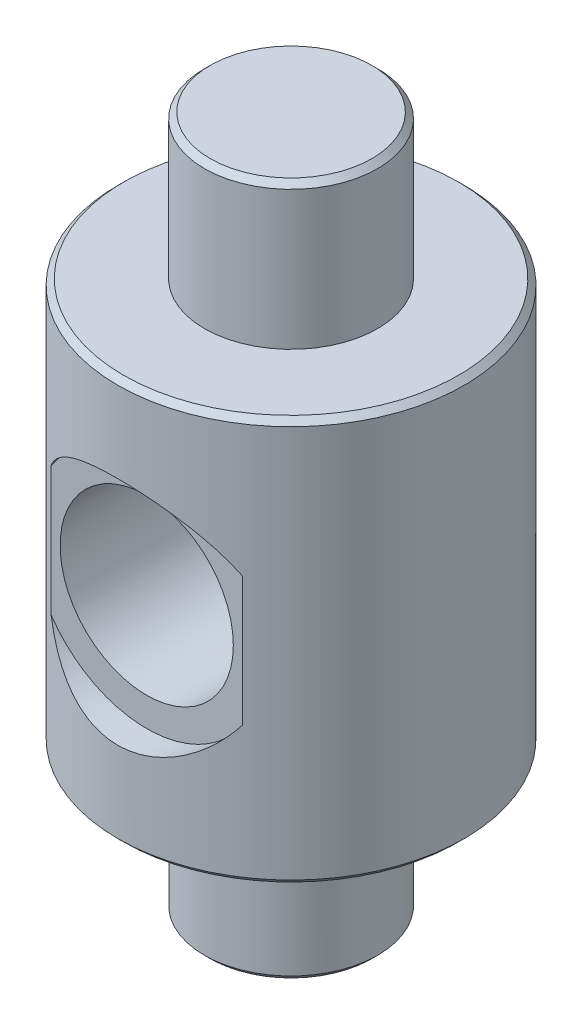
ISO-10303-21;
HEADER;
FILE_DESCRIPTION(('STEP AP214'),'2;1');
FILE_NAME('part.step','',(''),(''),'','','');
FILE_SCHEMA(('AUTOMOTIVE_DESIGN { 1 0 10303 214 1 1 1 1 }'));
ENDSEC;
DATA;
#1=APPLICATION_CONTEXT('core data for automotive mechanical design processes');
#2=APPLICATION_PROTOCOL_DEFINITION('international standard','automotive_design',2000,#1);
#3=PRODUCT_CONTEXT('',#1,'mechanical');
#4=PRODUCT('Part','Part','',(#3));
#5=PRODUCT_RELATED_PRODUCT_CATEGORY('part','',(#4));
#6=PRODUCT_DEFINITION_FORMATION('','',#4);
#7=PRODUCT_DEFINITION_CONTEXT('part definition',#1,'design');
#8=PRODUCT_DEFINITION('design','',#6,#7);
#9=PRODUCT_DEFINITION_SHAPE('','',#8);
#10=(LENGTH_UNIT() NAMED_UNIT(*) SI_UNIT(.MILLI.,.METRE.));
#11=(NAMED_UNIT(*) PLANE_ANGLE_UNIT() SI_UNIT($,.RADIAN.));
#12=(NAMED_UNIT(*) SI_UNIT($,.STERADIAN.) SOLID_ANGLE_UNIT());
#13=UNCERTAINTY_MEASURE_WITH_UNIT(LENGTH_MEASURE(1.E-05),#10,'distance_accuracy_value','');
#14=(GEOMETRIC_REPRESENTATION_CONTEXT(3) GLOBAL_UNCERTAINTY_ASSIGNED_CONTEXT((#13)) GLOBAL_UNIT_ASSIGNED_CONTEXT((#10,
#11,#12)) REPRESENTATION_CONTEXT('',''));
#15=CARTESIAN_POINT('',(0.,0.,0.));
#16=DIRECTION('',(0.,0.,1.));
#17=DIRECTION('',(1.,0.,0.));
#18=AXIS2_PLACEMENT_3D('',#15,#16,#17);
#19=CARTESIAN_POINT('',(0.,0.,0.));
#20=DIRECTION('',(0.,1.,0.));
#21=DIRECTION('',(0.,0.,1.));
#22=AXIS2_PLACEMENT_3D('',#19,#20,#21);
#23=CYLINDRICAL_SURFACE('',#22,3.);
#24=CARTESIAN_POINT('',(0.,2.6,0.));
#25=DIRECTION('',(0.,-1.,0.));
#26=DIRECTION('',(0.,0.,-1.));
#27=AXIS2_PLACEMENT_3D('',#24,#25,#26);
#28=CIRCLE('',#27,3.);
#29=CARTESIAN_POINT('',(0.,2.6,3.));
#30=VERTEX_POINT('',#29);
#31=EDGE_CURVE('E188',#30,#30,#28,.F.);
#32=ORIENTED_EDGE('',*,*,#31,.T.);
#33=EDGE_LOOP('',(#32));
#34=FACE_BOUND('',#33,.T.);
#35=CARTESIAN_POINT('',(0.,9.4,0.));
#36=DIRECTION('',(0.,1.,0.));
#37=DIRECTION('',(0.,0.,1.));
#38=AXIS2_PLACEMENT_3D('',#35,#36,#37);
#39=CIRCLE('',#38,3.);
#40=CARTESIAN_POINT('',(0.,9.4,3.));
#41=VERTEX_POINT('',#40);
#42=EDGE_CURVE('E191',#41,#41,#39,.F.);
#43=ORIENTED_EDGE('',*,*,#42,.T.);
#44=EDGE_LOOP('',(#43));
#45=FACE_BOUND('',#44,.T.);
#46=CARTESIAN_POINT('',(1.6583123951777,7.11803398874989,2.5));
#47=CARTESIAN_POINT('',(1.62588041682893,7.16611825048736,2.52151479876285));
#48=CARTESIAN_POINT('',(1.59147775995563,7.21265161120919,2.54342347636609));
#49=CARTESIAN_POINT('',(1.51881718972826,7.30251544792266,2.5874697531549));
#50=CARTESIAN_POINT('',(1.48055809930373,7.34584493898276,2.60960742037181));
#51=CARTESIAN_POINT('',(1.35957897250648,7.47143319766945,2.67582114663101));
#52=CARTESIAN_POINT('',(1.27112677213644,7.54859526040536,2.71937159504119));
#53=CARTESIAN_POINT('',(1.08001742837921,7.68747041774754,2.80078430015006));
#54=CARTESIAN_POINT('',(0.977318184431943,7.74913614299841,2.83862897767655));
#55=CARTESIAN_POINT('',(0.760170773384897,7.85379775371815,2.90429124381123));
#56=CARTESIAN_POINT('',(0.645766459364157,7.896860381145,2.93214461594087));
#57=CARTESIAN_POINT('',(0.422457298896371,7.95788993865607,2.97201413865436));
#58=CARTESIAN_POINT('',(0.314455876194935,7.97818990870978,2.98549347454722));
#59=CARTESIAN_POINT('',(0.0957318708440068,8.00072276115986,3.00046894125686));
#60=CARTESIAN_POINT('',(-0.0149896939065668,8.00296230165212,3.00196948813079));
#61=CARTESIAN_POINT('',(-0.219788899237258,7.9901684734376,2.99345292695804));
#62=CARTESIAN_POINT('',(-0.314087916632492,7.97743571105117,2.98496974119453));
#63=CARTESIAN_POINT('',(-0.498831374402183,7.93908854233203,2.95970537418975));
#64=CARTESIAN_POINT('',(-0.589276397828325,7.91347609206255,2.94292545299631));
#65=CARTESIAN_POINT('',(-0.766037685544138,7.84991700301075,2.90199776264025));
#66=CARTESIAN_POINT('',(-0.852235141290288,7.81173384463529,2.87770930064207));
#67=CARTESIAN_POINT('',(-1.01715798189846,7.72455932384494,2.8236387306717));
#68=CARTESIAN_POINT('',(-1.09587569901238,7.67555703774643,2.79385107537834));
#69=CARTESIAN_POINT('',(-1.25565427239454,7.56025585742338,2.72615287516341));
#70=CARTESIAN_POINT('',(-1.33541158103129,7.49248101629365,2.68769051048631));
#71=CARTESIAN_POINT('',(-1.48295801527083,7.34596800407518,2.60917581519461));
#72=CARTESIAN_POINT('',(-1.55076586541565,7.26724733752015,2.56912609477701));
#73=CARTESIAN_POINT('',(-1.62799531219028,7.16204151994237,2.51991822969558));
#74=CARTESIAN_POINT('',(-1.64336841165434,7.14019728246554,2.5099145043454));
#75=CARTESIAN_POINT('',(-1.6583123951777,7.11803398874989,2.5));
#76=B_SPLINE_CURVE_WITH_KNOTS('',3,(#46,#47,#48,#49,#50,#51,#52,#53,#54,#55,#56,#57,#58,#59,#60,
#61,#62,#63,#64,#65,#66,#67,#68,#69,#70,#71,#72,#73,#74,#75),.UNSPECIFIED.,.F.,.F.,(4,2,2,2,2,2,
2,2,2,2,2,2,2,2,4),(0.,0.185463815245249,0.370984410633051,0.744697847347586,1.1195401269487,
1.49302619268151,1.82315350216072,2.1531591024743,2.43842427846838,2.72364614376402,
3.01457448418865,3.30579791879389,3.6390815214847,3.97183814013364,4.05738621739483),.UNSPECIFIED.);
#77=CARTESIAN_POINT('',(1.6583123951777,7.11803398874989,2.5));
#78=VERTEX_POINT('',#77);
#79=CARTESIAN_POINT('',(-1.6583123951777,7.11803398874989,2.5));
#80=VERTEX_POINT('',#79);
#81=EDGE_CURVE('E144',#78,#80,#76,.T.);
#82=ORIENTED_EDGE('',*,*,#81,.F.);
#83=DIRECTION('',(0.,1.,0.));
#84=VECTOR('',#83,1.);
#85=CARTESIAN_POINT('',(1.6583123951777,0.,2.5));
#86=LINE('',#85,#84);
#87=CARTESIAN_POINT('',(1.6583123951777,4.88196601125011,2.5));
#88=VERTEX_POINT('',#87);
#89=EDGE_CURVE('E95',#78,#88,#86,.F.);
#90=ORIENTED_EDGE('',*,*,#89,.T.);
#91=CARTESIAN_POINT('',(-1.6583123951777,4.88196601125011,2.5));
#92=CARTESIAN_POINT('',(-1.62588041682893,4.83388174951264,2.52151479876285));
#93=CARTESIAN_POINT('',(-1.59147775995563,4.78734838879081,2.54342347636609));
#94=CARTESIAN_POINT('',(-1.51881718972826,4.69748455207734,2.5874697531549));
#95=CARTESIAN_POINT('',(-1.48055809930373,4.65415506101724,2.60960742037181));
#96=CARTESIAN_POINT('',(-1.35957897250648,4.52856680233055,2.67582114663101));
#97=CARTESIAN_POINT('',(-1.27112677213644,4.45140473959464,2.71937159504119));
#98=CARTESIAN_POINT('',(-1.08001742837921,4.31252958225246,2.80078430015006));
#99=CARTESIAN_POINT('',(-0.977318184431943,4.25086385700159,2.83862897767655));
#100=CARTESIAN_POINT('',(-0.760170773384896,4.14620224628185,2.90429124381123));
#101=CARTESIAN_POINT('',(-0.645766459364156,4.103139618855,2.93214461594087));
#102=CARTESIAN_POINT('',(-0.42245729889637,4.04211006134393,2.97201413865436));
#103=CARTESIAN_POINT('',(-0.314455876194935,4.02181009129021,2.98549347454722));
#104=CARTESIAN_POINT('',(-0.0957318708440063,3.99927723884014,3.00046894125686));
#105=CARTESIAN_POINT('',(0.0149896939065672,3.99703769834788,3.00196948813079));
#106=CARTESIAN_POINT('',(0.219788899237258,4.00983152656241,2.99345292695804));
#107=CARTESIAN_POINT('',(0.314087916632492,4.02256428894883,2.98496974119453));
#108=CARTESIAN_POINT('',(0.498831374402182,4.06091145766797,2.95970537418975));
#109=CARTESIAN_POINT('',(0.589276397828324,4.08652390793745,2.94292545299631));
#110=CARTESIAN_POINT('',(0.766037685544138,4.15008299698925,2.90199776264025));
#111=CARTESIAN_POINT('',(0.852235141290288,4.18826615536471,2.87770930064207));
#112=CARTESIAN_POINT('',(1.01715798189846,4.27544067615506,2.8236387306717));
#113=CARTESIAN_POINT('',(1.09587569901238,4.32444296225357,2.79385107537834));
#114=CARTESIAN_POINT('',(1.25565427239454,4.43974414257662,2.72615287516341));
#115=CARTESIAN_POINT('',(1.33541158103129,4.50751898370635,2.68769051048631));
#116=CARTESIAN_POINT('',(1.48295801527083,4.65403199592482,2.60917581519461));
#117=CARTESIAN_POINT('',(1.55076586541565,4.73275266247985,2.56912609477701));
#118=CARTESIAN_POINT('',(1.62799531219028,4.83795848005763,2.51991822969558));
#119=CARTESIAN_POINT('',(1.64336841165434,4.85980271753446,2.5099145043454));
#120=CARTESIAN_POINT('',(1.6583123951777,4.88196601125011,2.5));
#121=B_SPLINE_CURVE_WITH_KNOTS('',3,(#91,#92,#93,#94,#95,#96,#97,#98,#99,#100,#101,#102,#103,
#104,#105,#106,#107,#108,#109,#110,#111,#112,#113,#114,#115,#116,#117,#118,#119,#120),
.UNSPECIFIED.,.F.,.F.,(4,2,2,2,2,2,2,2,2,2,2,2,2,2,4),(0.,0.185463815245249,0.370984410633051,
0.744697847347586,1.1195401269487,1.49302619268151,1.82315350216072,2.1531591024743,
2.43842427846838,2.72364614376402,3.01457448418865,3.30579791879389,3.6390815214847,
3.97183814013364,4.05738621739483),.UNSPECIFIED.);
#122=CARTESIAN_POINT('',(-1.6583123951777,4.88196601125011,2.5));
#123=VERTEX_POINT('',#122);
#124=EDGE_CURVE('E137',#123,#88,#121,.T.);
#125=ORIENTED_EDGE('',*,*,#124,.F.);
#126=DIRECTION('',(0.,1.,0.));
#127=VECTOR('',#126,1.);
#128=CARTESIAN_POINT('',(-1.6583123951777,0.,2.5));
#129=LINE('',#128,#127);
#130=EDGE_CURVE('E99',#123,#80,#129,.T.);
#131=ORIENTED_EDGE('',*,*,#130,.T.);
#132=EDGE_LOOP('',(#82,#90,#125,#131));
#133=FACE_BOUND('',#132,.T.);
#134=DIRECTION('',(0.,1.,0.));
#135=VECTOR('',#134,1.);
#136=CARTESIAN_POINT('',(-1.6583123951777,0.,-2.5));
#137=LINE('',#136,#135);
#138=CARTESIAN_POINT('',(-1.6583123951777,7.11803398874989,-2.5));
#139=VERTEX_POINT('',#138);
#140=CARTESIAN_POINT('',(-1.6583123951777,4.88196601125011,-2.5));
#141=VERTEX_POINT('',#140);
#142=EDGE_CURVE('E80',#139,#141,#137,.F.);
#143=ORIENTED_EDGE('',*,*,#142,.T.);
#144=CARTESIAN_POINT('',(-1.6583123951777,4.88196601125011,-2.5));
#145=CARTESIAN_POINT('',(-1.62588041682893,4.83388174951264,-2.52151479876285));
#146=CARTESIAN_POINT('',(-1.59147775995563,4.78734838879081,-2.54342347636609));
#147=CARTESIAN_POINT('',(-1.51881718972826,4.69748455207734,-2.5874697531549));
#148=CARTESIAN_POINT('',(-1.48055809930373,4.65415506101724,-2.60960742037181));
#149=CARTESIAN_POINT('',(-1.35957897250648,4.52856680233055,-2.67582114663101));
#150=CARTESIAN_POINT('',(-1.27112677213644,4.45140473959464,-2.71937159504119));
#151=CARTESIAN_POINT('',(-1.08001742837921,4.31252958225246,-2.80078430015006));
#152=CARTESIAN_POINT('',(-0.977318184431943,4.25086385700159,-2.83862897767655));
#153=CARTESIAN_POINT('',(-0.760170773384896,4.14620224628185,-2.90429124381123));
#154=CARTESIAN_POINT('',(-0.645766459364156,4.103139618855,-2.93214461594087));
#155=CARTESIAN_POINT('',(-0.42245729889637,4.04211006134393,-2.97201413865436));
#156=CARTESIAN_POINT('',(-0.314455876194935,4.02181009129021,-2.98549347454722));
#157=CARTESIAN_POINT('',(-0.0957318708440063,3.99927723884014,-3.00046894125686));
#158=CARTESIAN_POINT('',(0.0149896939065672,3.99703769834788,-3.00196948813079));
#159=CARTESIAN_POINT('',(0.219788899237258,4.00983152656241,-2.99345292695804));
#160=CARTESIAN_POINT('',(0.314087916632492,4.02256428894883,-2.98496974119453));
#161=CARTESIAN_POINT('',(0.498831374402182,4.06091145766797,-2.95970537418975));
#162=CARTESIAN_POINT('',(0.589276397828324,4.08652390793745,-2.94292545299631));
#163=CARTESIAN_POINT('',(0.766037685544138,4.15008299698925,-2.90199776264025));
#164=CARTESIAN_POINT('',(0.852235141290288,4.18826615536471,-2.87770930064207));
#165=CARTESIAN_POINT('',(1.01715798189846,4.27544067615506,-2.8236387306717));
#166=CARTESIAN_POINT('',(1.09587569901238,4.32444296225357,-2.79385107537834));
#167=CARTESIAN_POINT('',(1.25565427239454,4.43974414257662,-2.72615287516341));
#168=CARTESIAN_POINT('',(1.33541158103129,4.50751898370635,-2.68769051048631));
#169=CARTESIAN_POINT('',(1.48295801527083,4.65403199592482,-2.60917581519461));
#170=CARTESIAN_POINT('',(1.55076586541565,4.73275266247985,-2.56912609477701));
#171=CARTESIAN_POINT('',(1.62799531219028,4.83795848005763,-2.51991822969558));
#172=CARTESIAN_POINT('',(1.64336841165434,4.85980271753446,-2.5099145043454));
#173=CARTESIAN_POINT('',(1.6583123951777,4.88196601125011,-2.5));
#174=B_SPLINE_CURVE_WITH_KNOTS('',3,(#144,#145,#146,#147,#148,#149,#150,#151,#152,#153,#154,
#155,#156,#157,#158,#159,#160,#161,#162,#163,#164,#165,#166,#167,#168,#169,#170,#171,#172,#173),
.UNSPECIFIED.,.F.,.F.,(4,2,2,2,2,2,2,2,2,2,2,2,2,2,4),(0.,0.185463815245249,0.370984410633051,
0.744697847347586,1.1195401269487,1.49302619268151,1.82315350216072,2.1531591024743,
2.43842427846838,2.72364614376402,3.01457448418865,3.30579791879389,3.6390815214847,
3.97183814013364,4.05738621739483),.UNSPECIFIED.);
#175=CARTESIAN_POINT('',(1.6583123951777,4.88196601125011,-2.5));
#176=VERTEX_POINT('',#175);
#177=EDGE_CURVE('E94',#141,#176,#174,.T.);
#178=ORIENTED_EDGE('',*,*,#177,.T.);
#179=DIRECTION('',(0.,1.,0.));
#180=VECTOR('',#179,1.);
#181=CARTESIAN_POINT('',(1.6583123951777,0.,-2.5));
#182=LINE('',#181,#180);
#183=CARTESIAN_POINT('',(1.6583123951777,7.11803398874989,-2.5));
#184=VERTEX_POINT('',#183);
#185=EDGE_CURVE('E89',#176,#184,#182,.T.);
#186=ORIENTED_EDGE('',*,*,#185,.T.);
#187=CARTESIAN_POINT('',(1.6583123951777,7.11803398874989,-2.5));
#188=CARTESIAN_POINT('',(1.62588041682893,7.16611825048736,-2.52151479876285));
#189=CARTESIAN_POINT('',(1.59147775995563,7.21265161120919,-2.54342347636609));
#190=CARTESIAN_POINT('',(1.51881718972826,7.30251544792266,-2.5874697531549));
#191=CARTESIAN_POINT('',(1.48055809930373,7.34584493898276,-2.60960742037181));
#192=CARTESIAN_POINT('',(1.35957897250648,7.47143319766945,-2.67582114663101));
#193=CARTESIAN_POINT('',(1.27112677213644,7.54859526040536,-2.71937159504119));
#194=CARTESIAN_POINT('',(1.08001742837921,7.68747041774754,-2.80078430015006));
#195=CARTESIAN_POINT('',(0.977318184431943,7.74913614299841,-2.83862897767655));
#196=CARTESIAN_POINT('',(0.760170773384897,7.85379775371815,-2.90429124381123));
#197=CARTESIAN_POINT('',(0.645766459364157,7.896860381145,-2.93214461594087));
#198=CARTESIAN_POINT('',(0.422457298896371,7.95788993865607,-2.97201413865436));
#199=CARTESIAN_POINT('',(0.314455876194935,7.97818990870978,-2.98549347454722));
#200=CARTESIAN_POINT('',(0.0957318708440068,8.00072276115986,-3.00046894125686));
#201=CARTESIAN_POINT('',(-0.0149896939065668,8.00296230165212,-3.00196948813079));
#202=CARTESIAN_POINT('',(-0.219788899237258,7.9901684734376,-2.99345292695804));
#203=CARTESIAN_POINT('',(-0.314087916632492,7.97743571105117,-2.98496974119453));
#204=CARTESIAN_POINT('',(-0.498831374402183,7.93908854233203,-2.95970537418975));
#205=CARTESIAN_POINT('',(-0.589276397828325,7.91347609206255,-2.94292545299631));
#206=CARTESIAN_POINT('',(-0.766037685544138,7.84991700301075,-2.90199776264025));
#207=CARTESIAN_POINT('',(-0.852235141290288,7.81173384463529,-2.87770930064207));
#208=CARTESIAN_POINT('',(-1.01715798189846,7.72455932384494,-2.8236387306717));
#209=CARTESIAN_POINT('',(-1.09587569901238,7.67555703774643,-2.79385107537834));
#210=CARTESIAN_POINT('',(-1.25565427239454,7.56025585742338,-2.72615287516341));
#211=CARTESIAN_POINT('',(-1.33541158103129,7.49248101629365,-2.68769051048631));
#212=CARTESIAN_POINT('',(-1.48295801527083,7.34596800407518,-2.60917581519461));
#213=CARTESIAN_POINT('',(-1.55076586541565,7.26724733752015,-2.56912609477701));
#214=CARTESIAN_POINT('',(-1.62799531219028,7.16204151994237,-2.51991822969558));
#215=CARTESIAN_POINT('',(-1.64336841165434,7.14019728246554,-2.5099145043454));
#216=CARTESIAN_POINT('',(-1.6583123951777,7.11803398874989,-2.5));
#217=B_SPLINE_CURVE_WITH_KNOTS('',3,(#187,#188,#189,#190,#191,#192,#193,#194,#195,#196,#197,
#198,#199,#200,#201,#202,#203,#204,#205,#206,#207,#208,#209,#210,#211,#212,#213,#214,#215,#216),
.UNSPECIFIED.,.F.,.F.,(4,2,2,2,2,2,2,2,2,2,2,2,2,2,4),(0.,0.185463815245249,0.370984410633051,
0.744697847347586,1.1195401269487,1.49302619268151,1.82315350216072,2.1531591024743,
2.43842427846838,2.72364614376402,3.01457448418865,3.30579791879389,3.6390815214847,
3.97183814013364,4.05738621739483),.UNSPECIFIED.);
#218=EDGE_CURVE('E50',#184,#139,#217,.T.);
#219=ORIENTED_EDGE('',*,*,#218,.T.);
#220=EDGE_LOOP('',(#143,#178,#186,#219));
#221=FACE_BOUND('',#220,.T.);
#222=ADVANCED_FACE('F35',(#34,#45,#133,#221),#23,.T.);
#223=CARTESIAN_POINT('',(0.,12.,0.));
#224=DIRECTION('',(0.,1.,0.));
#225=DIRECTION('',(0.,0.,1.));
#226=AXIS2_PLACEMENT_3D('',#223,#224,#225);
#227=PLANE('',#226);
#228=CARTESIAN_POINT('',(0.,12.,0.));
#229=DIRECTION('',(0.,1.,0.));
#230=DIRECTION('',(0.,0.,1.));
#231=AXIS2_PLACEMENT_3D('',#228,#229,#230);
#232=CIRCLE('',#231,1.4);
#233=CARTESIAN_POINT('',(0.,12.,1.4));
#234=VERTEX_POINT('',#233);
#235=EDGE_CURVE('E44',#234,#234,#232,.T.);
#236=ORIENTED_EDGE('',*,*,#235,.T.);
#237=EDGE_LOOP('',(#236));
#238=FACE_BOUND('',#237,.T.);
#239=ADVANCED_FACE('F174',(#238),#227,.T.);
#240=CARTESIAN_POINT('',(0.,0.,0.));
#241=DIRECTION('',(0.,1.,0.));
#242=DIRECTION('',(0.,0.,1.));
#243=AXIS2_PLACEMENT_3D('',#240,#241,#242);
#244=CYLINDRICAL_SURFACE('',#243,1.5);
#245=CARTESIAN_POINT('',(0.,11.9,0.));
#246=DIRECTION('',(0.,1.,0.));
#247=DIRECTION('',(0.,0.,1.));
#248=AXIS2_PLACEMENT_3D('',#245,#246,#247);
#249=CIRCLE('',#248,1.5);
#250=CARTESIAN_POINT('',(0.,11.9,1.5));
#251=VERTEX_POINT('',#250);
#252=EDGE_CURVE('E11',#251,#251,#249,.F.);
#253=ORIENTED_EDGE('',*,*,#252,.T.);
#254=EDGE_LOOP('',(#253));
#255=FACE_BOUND('',#254,.T.);
#256=CARTESIAN_POINT('',(0.,9.5,0.));
#257=DIRECTION('',(0.,1.,0.));
#258=DIRECTION('',(0.,0.,1.));
#259=AXIS2_PLACEMENT_3D('',#256,#257,#258);
#260=CIRCLE('',#259,1.5);
#261=CARTESIAN_POINT('',(0.,9.5,1.5));
#262=VERTEX_POINT('',#261);
#263=EDGE_CURVE('E158',#262,#262,#260,.T.);
#264=ORIENTED_EDGE('',*,*,#263,.T.);
#265=EDGE_LOOP('',(#264));
#266=FACE_BOUND('',#265,.T.);
#267=ADVANCED_FACE('F162',(#255,#266),#244,.T.);
#268=CARTESIAN_POINT('',(-1.5,9.5,0.));
#269=DIRECTION('',(0.,1.,0.));
#270=DIRECTION('',(0.,0.,1.));
#271=AXIS2_PLACEMENT_3D('',#268,#269,#270);
#272=PLANE('',#271);
#273=CARTESIAN_POINT('',(0.,9.5,0.));
#274=DIRECTION('',(0.,1.,0.));
#275=DIRECTION('',(0.,0.,1.));
#276=AXIS2_PLACEMENT_3D('',#273,#274,#275);
#277=CIRCLE('',#276,2.9);
#278=CARTESIAN_POINT('',(0.,9.5,2.9));
#279=VERTEX_POINT('',#278);
#280=EDGE_CURVE('E203',#279,#279,#277,.T.);
#281=ORIENTED_EDGE('',*,*,#280,.T.);
#282=EDGE_LOOP('',(#281));
#283=FACE_BOUND('',#282,.T.);
#284=ORIENTED_EDGE('',*,*,#263,.F.);
#285=EDGE_LOOP('',(#284));
#286=FACE_BOUND('',#285,.T.);
#287=ADVANCED_FACE('F164',(#283,#286),#272,.T.);
#288=CARTESIAN_POINT('',(-3.,2.5,0.));
#289=DIRECTION('',(0.,-1.,0.));
#290=DIRECTION('',(0.,0.,-1.));
#291=AXIS2_PLACEMENT_3D('',#288,#289,#290);
#292=PLANE('',#291);
#293=CARTESIAN_POINT('',(0.,2.5,0.));
#294=DIRECTION('',(0.,-1.,0.));
#295=DIRECTION('',(0.,0.,-1.));
#296=AXIS2_PLACEMENT_3D('',#293,#294,#295);
#297=CIRCLE('',#296,2.9);
#298=CARTESIAN_POINT('',(0.,2.5,2.9));
#299=VERTEX_POINT('',#298);
#300=EDGE_CURVE('E195',#299,#299,#297,.T.);
#301=ORIENTED_EDGE('',*,*,#300,.T.);
#302=EDGE_LOOP('',(#301));
#303=FACE_BOUND('',#302,.T.);
#304=CARTESIAN_POINT('',(0.,2.5,0.));
#305=DIRECTION('',(0.,1.,0.));
#306=DIRECTION('',(0.,0.,1.));
#307=AXIS2_PLACEMENT_3D('',#304,#305,#306);
#308=CIRCLE('',#307,1.5);
#309=CARTESIAN_POINT('',(0.,2.5,1.5));
#310=VERTEX_POINT('',#309);
#311=EDGE_CURVE('E154',#310,#310,#308,.T.);
#312=ORIENTED_EDGE('',*,*,#311,.T.);
#313=EDGE_LOOP('',(#312));
#314=FACE_BOUND('',#313,.T.);
#315=ADVANCED_FACE('F166',(#303,#314),#292,.T.);
#316=CARTESIAN_POINT('',(0.,0.,0.));
#317=DIRECTION('',(0.,1.,0.));
#318=DIRECTION('',(0.,0.,1.));
#319=AXIS2_PLACEMENT_3D('',#316,#317,#318);
#320=CYLINDRICAL_SURFACE('',#319,1.5);
#321=CARTESIAN_POINT('',(0.,0.1,0.));
#322=DIRECTION('',(0.,-1.,0.));
#323=DIRECTION('',(0.,0.,-1.));
#324=AXIS2_PLACEMENT_3D('',#321,#322,#323);
#325=CIRCLE('',#324,1.5);
#326=CARTESIAN_POINT('',(0.,0.1,-1.5));
#327=VERTEX_POINT('',#326);
#328=EDGE_CURVE('E88',#327,#327,#325,.F.);
#329=ORIENTED_EDGE('',*,*,#328,.T.);
#330=EDGE_LOOP('',(#329));
#331=FACE_BOUND('',#330,.T.);
#332=ORIENTED_EDGE('',*,*,#311,.F.);
#333=EDGE_LOOP('',(#332));
#334=FACE_BOUND('',#333,.T.);
#335=ADVANCED_FACE('F172',(#331,#334),#320,.T.);
#336=CARTESIAN_POINT('',(-1.5,0.,0.));
#337=DIRECTION('',(0.,-1.,0.));
#338=DIRECTION('',(0.,0.,-1.));
#339=AXIS2_PLACEMENT_3D('',#336,#337,#338);
#340=PLANE('',#339);
#341=CARTESIAN_POINT('',(0.,0.,0.));
#342=DIRECTION('',(0.,-1.,0.));
#343=DIRECTION('',(0.,0.,-1.));
#344=AXIS2_PLACEMENT_3D('',#341,#342,#343);
#345=CIRCLE('',#344,1.4);
#346=CARTESIAN_POINT('',(0.,0.,-1.4));
#347=VERTEX_POINT('',#346);
#348=EDGE_CURVE('E193',#347,#347,#345,.T.);
#349=ORIENTED_EDGE('',*,*,#348,.T.);
#350=EDGE_LOOP('',(#349));
#351=FACE_BOUND('',#350,.T.);
#352=ADVANCED_FACE('F133',(#351),#340,.T.);
#353=CARTESIAN_POINT('',(0.,6.,2.5));
#354=DIRECTION('',(0.,0.,1.));
#355=DIRECTION('',(1.,0.,0.));
#356=AXIS2_PLACEMENT_3D('',#353,#354,#355);
#357=CYLINDRICAL_SURFACE('',#356,2.);
#358=CARTESIAN_POINT('',(0.,6.,2.5));
#359=DIRECTION('',(0.,0.,1.));
#360=DIRECTION('',(1.,0.,0.));
#361=AXIS2_PLACEMENT_3D('',#358,#359,#360);
#362=CIRCLE('',#361,2.);
#363=EDGE_CURVE('E58',#78,#80,#362,.T.);
#364=ORIENTED_EDGE('',*,*,#363,.F.);
#365=ORIENTED_EDGE('',*,*,#81,.T.);
#366=EDGE_LOOP('',(#364,#365));
#367=FACE_BOUND('',#366,.T.);
#368=ADVANCED_FACE('F131',(#367),#357,.F.);
#369=EDGE_CURVE('E92',#123,#88,#362,.T.);
#370=ORIENTED_EDGE('',*,*,#369,.F.);
#371=ORIENTED_EDGE('',*,*,#124,.T.);
#372=EDGE_LOOP('',(#370,#371));
#373=FACE_BOUND('',#372,.T.);
#374=ADVANCED_FACE('F126',(#373),#357,.F.);
#375=CARTESIAN_POINT('',(0.,6.,2.5));
#376=DIRECTION('',(0.,0.,1.));
#377=DIRECTION('',(1.,0.,0.));
#378=AXIS2_PLACEMENT_3D('',#375,#376,#377);
#379=PLANE('',#378);
#380=CARTESIAN_POINT('',(0.,6.,2.5));
#381=DIRECTION('',(0.,0.,1.));
#382=DIRECTION('',(1.,0.,0.));
#383=AXIS2_PLACEMENT_3D('',#380,#381,#382);
#384=CIRCLE('',#383,1.5);
#385=CARTESIAN_POINT('',(1.5,6.,2.5));
#386=VERTEX_POINT('',#385);
#387=EDGE_CURVE('E247',#386,#386,#384,.T.);
#388=ORIENTED_EDGE('',*,*,#387,.F.);
#389=EDGE_LOOP('',(#388));
#390=FACE_BOUND('',#389,.T.);
#391=ORIENTED_EDGE('',*,*,#363,.T.);
#392=ORIENTED_EDGE('',*,*,#130,.F.);
#393=ORIENTED_EDGE('',*,*,#369,.T.);
#394=ORIENTED_EDGE('',*,*,#89,.F.);
#395=EDGE_LOOP('',(#391,#392,#393,#394));
#396=FACE_BOUND('',#395,.T.);
#397=ADVANCED_FACE('F122',(#390,#396),#379,.T.);
#398=CARTESIAN_POINT('',(0.,6.,-2.5));
#399=DIRECTION('',(0.,0.,-1.));
#400=DIRECTION('',(-1.,0.,0.));
#401=AXIS2_PLACEMENT_3D('',#398,#399,#400);
#402=CYLINDRICAL_SURFACE('',#401,2.);
#403=CARTESIAN_POINT('',(0.,6.,-2.5));
#404=DIRECTION('',(0.,0.,1.));
#405=DIRECTION('',(1.,0.,0.));
#406=AXIS2_PLACEMENT_3D('',#403,#404,#405);
#407=CIRCLE('',#406,2.);
#408=EDGE_CURVE('E85',#141,#176,#407,.T.);
#409=ORIENTED_EDGE('',*,*,#408,.T.);
#410=ORIENTED_EDGE('',*,*,#177,.F.);
#411=EDGE_LOOP('',(#409,#410));
#412=FACE_BOUND('',#411,.T.);
#413=ADVANCED_FACE('F120',(#412),#402,.F.);
#414=EDGE_CURVE('E82',#184,#139,#407,.T.);
#415=ORIENTED_EDGE('',*,*,#414,.T.);
#416=ORIENTED_EDGE('',*,*,#218,.F.);
#417=EDGE_LOOP('',(#415,#416));
#418=FACE_BOUND('',#417,.T.);
#419=ADVANCED_FACE('F91',(#418),#402,.F.);
#420=CARTESIAN_POINT('',(0.,6.,-2.5));
#421=DIRECTION('',(0.,0.,-1.));
#422=DIRECTION('',(1.,0.,0.));
#423=AXIS2_PLACEMENT_3D('',#420,#421,#422);
#424=PLANE('',#423);
#425=CARTESIAN_POINT('',(0.,6.,-2.5));
#426=DIRECTION('',(0.,0.,-1.));
#427=DIRECTION('',(-1.,0.,0.));
#428=AXIS2_PLACEMENT_3D('',#425,#426,#427);
#429=CIRCLE('',#428,1.5);
#430=CARTESIAN_POINT('',(-1.5,6.,-2.5));
#431=VERTEX_POINT('',#430);
#432=EDGE_CURVE('E245',#431,#431,#429,.T.);
#433=ORIENTED_EDGE('',*,*,#432,.F.);
#434=EDGE_LOOP('',(#433));
#435=FACE_BOUND('',#434,.T.);
#436=ORIENTED_EDGE('',*,*,#414,.F.);
#437=ORIENTED_EDGE('',*,*,#185,.F.);
#438=ORIENTED_EDGE('',*,*,#408,.F.);
#439=ORIENTED_EDGE('',*,*,#142,.F.);
#440=EDGE_LOOP('',(#436,#437,#438,#439));
#441=FACE_BOUND('',#440,.T.);
#442=ADVANCED_FACE('F81',(#435,#441),#424,.T.);
#443=CARTESIAN_POINT('',(0.,6.,-3.));
#444=DIRECTION('',(0.,0.,1.));
#445=DIRECTION('',(1.,0.,0.));
#446=AXIS2_PLACEMENT_3D('',#443,#444,#445);
#447=CYLINDRICAL_SURFACE('',#446,1.5);
#448=ORIENTED_EDGE('',*,*,#432,.T.);
#449=EDGE_LOOP('',(#448));
#450=FACE_BOUND('',#449,.T.);
#451=ORIENTED_EDGE('',*,*,#387,.T.);
#452=EDGE_LOOP('',(#451));
#453=FACE_BOUND('',#452,.T.);
#454=ADVANCED_FACE('F233',(#450,#453),#447,.F.);
#455=CARTESIAN_POINT('',(0.,0.1,0.));
#456=DIRECTION('',(0.,1.,0.));
#457=DIRECTION('',(0.,0.,1.));
#458=AXIS2_PLACEMENT_3D('',#455,#456,#457);
#459=CONICAL_SURFACE('',#458,1.5,0.785398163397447);
#460=ORIENTED_EDGE('',*,*,#348,.F.);
#461=EDGE_LOOP('',(#460));
#462=FACE_BOUND('',#461,.T.);
#463=ORIENTED_EDGE('',*,*,#328,.F.);
#464=EDGE_LOOP('',(#463));
#465=FACE_BOUND('',#464,.T.);
#466=ADVANCED_FACE('F218',(#462,#465),#459,.T.);
#467=CARTESIAN_POINT('',(0.,2.6,0.));
#468=DIRECTION('',(0.,1.,0.));
#469=DIRECTION('',(0.,0.,1.));
#470=AXIS2_PLACEMENT_3D('',#467,#468,#469);
#471=CONICAL_SURFACE('',#470,3.,0.785398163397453);
#472=CARTESIAN_POINT('',(0.,2.5,2.9));
#473=CARTESIAN_POINT('',(0.,2.50104166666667,2.90104166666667));
#474=CARTESIAN_POINT('',(0.,2.50208333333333,2.90208333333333));
#475=CARTESIAN_POINT('',(0.,2.50416666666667,2.90416666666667));
#476=CARTESIAN_POINT('',(0.,2.50520833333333,2.90520833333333));
#477=CARTESIAN_POINT('',(0.,2.50729166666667,2.90729166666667));
#478=CARTESIAN_POINT('',(0.,2.50833333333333,2.90833333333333));
#479=CARTESIAN_POINT('',(0.,2.51041666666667,2.91041666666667));
#480=CARTESIAN_POINT('',(0.,2.51145833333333,2.91145833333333));
#481=CARTESIAN_POINT('',(0.,2.51354166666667,2.91354166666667));
#482=CARTESIAN_POINT('',(0.,2.51458333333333,2.91458333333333));
#483=CARTESIAN_POINT('',(0.,2.51666666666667,2.91666666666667));
#484=CARTESIAN_POINT('',(0.,2.51770833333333,2.91770833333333));
#485=CARTESIAN_POINT('',(0.,2.51979166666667,2.91979166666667));
#486=CARTESIAN_POINT('',(0.,2.52083333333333,2.92083333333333));
#487=CARTESIAN_POINT('',(0.,2.52291666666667,2.92291666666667));
#488=CARTESIAN_POINT('',(0.,2.52395833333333,2.92395833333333));
#489=CARTESIAN_POINT('',(0.,2.52604166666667,2.92604166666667));
#490=CARTESIAN_POINT('',(0.,2.52708333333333,2.92708333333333));
#491=CARTESIAN_POINT('',(0.,2.52916666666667,2.92916666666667));
#492=CARTESIAN_POINT('',(0.,2.53020833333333,2.93020833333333));
#493=CARTESIAN_POINT('',(0.,2.53229166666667,2.93229166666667));
#494=CARTESIAN_POINT('',(0.,2.53333333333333,2.93333333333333));
#495=CARTESIAN_POINT('',(0.,2.53541666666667,2.93541666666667));
#496=CARTESIAN_POINT('',(0.,2.53645833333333,2.93645833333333));
#497=CARTESIAN_POINT('',(0.,2.53854166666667,2.93854166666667));
#498=CARTESIAN_POINT('',(0.,2.53958333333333,2.93958333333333));
#499=CARTESIAN_POINT('',(0.,2.54166666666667,2.94166666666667));
#500=CARTESIAN_POINT('',(0.,2.54270833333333,2.94270833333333));
#501=CARTESIAN_POINT('',(0.,2.54479166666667,2.94479166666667));
#502=CARTESIAN_POINT('',(0.,2.54583333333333,2.94583333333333));
#503=CARTESIAN_POINT('',(0.,2.54791666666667,2.94791666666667));
#504=CARTESIAN_POINT('',(0.,2.54895833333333,2.94895833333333));
#505=CARTESIAN_POINT('',(0.,2.55104166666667,2.95104166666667));
#506=CARTESIAN_POINT('',(0.,2.55208333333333,2.95208333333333));
#507=CARTESIAN_POINT('',(0.,2.55416666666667,2.95416666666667));
#508=CARTESIAN_POINT('',(0.,2.55520833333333,2.95520833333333));
#509=CARTESIAN_POINT('',(0.,2.55729166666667,2.95729166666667));
#510=CARTESIAN_POINT('',(0.,2.55833333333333,2.95833333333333));
#511=CARTESIAN_POINT('',(0.,2.56041666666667,2.96041666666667));
#512=CARTESIAN_POINT('',(0.,2.56145833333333,2.96145833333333));
#513=CARTESIAN_POINT('',(0.,2.56354166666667,2.96354166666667));
#514=CARTESIAN_POINT('',(0.,2.56458333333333,2.96458333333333));
#515=CARTESIAN_POINT('',(0.,2.56666666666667,2.96666666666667));
#516=CARTESIAN_POINT('',(0.,2.56770833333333,2.96770833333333));
#517=CARTESIAN_POINT('',(0.,2.56979166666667,2.96979166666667));
#518=CARTESIAN_POINT('',(0.,2.57083333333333,2.97083333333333));
#519=CARTESIAN_POINT('',(0.,2.57291666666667,2.97291666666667));
#520=CARTESIAN_POINT('',(0.,2.57395833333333,2.97395833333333));
#521=CARTESIAN_POINT('',(0.,2.57604166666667,2.97604166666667));
#522=CARTESIAN_POINT('',(0.,2.57708333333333,2.97708333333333));
#523=CARTESIAN_POINT('',(0.,2.57916666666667,2.97916666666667));
#524=CARTESIAN_POINT('',(0.,2.58020833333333,2.98020833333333));
#525=CARTESIAN_POINT('',(0.,2.58229166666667,2.98229166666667));
#526=CARTESIAN_POINT('',(0.,2.58333333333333,2.98333333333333));
#527=CARTESIAN_POINT('',(0.,2.58541666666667,2.98541666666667));
#528=CARTESIAN_POINT('',(0.,2.58645833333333,2.98645833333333));
#529=CARTESIAN_POINT('',(0.,2.58854166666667,2.98854166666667));
#530=CARTESIAN_POINT('',(0.,2.58958333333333,2.98958333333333));
#531=CARTESIAN_POINT('',(0.,2.59166666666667,2.99166666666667));
#532=CARTESIAN_POINT('',(0.,2.59270833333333,2.99270833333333));
#533=CARTESIAN_POINT('',(0.,2.59479166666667,2.99479166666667));
#534=CARTESIAN_POINT('',(0.,2.59583333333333,2.99583333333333));
#535=CARTESIAN_POINT('',(0.,2.59791666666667,2.99791666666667));
#536=CARTESIAN_POINT('',(0.,2.59895833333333,2.99895833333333));
#537=CARTESIAN_POINT('',(0.,2.6,3.));
#538=B_SPLINE_CURVE_WITH_KNOTS('',3,(#472,#473,#474,#475,#476,#477,#478,#479,#480,#481,#482,
#483,#484,#485,#486,#487,#488,#489,#490,#491,#492,#493,#494,#495,#496,#497,#498,#499,#500,#501,
#502,#503,#504,#505,#506,#507,#508,#509,#510,#511,#512,#513,#514,#515,#516,#517,#518,#519,#520,
#521,#522,#523,#524,#525,#526,#527,#528,#529,#530,#531,#532,#533,#534,#535,#536,#537),
.UNSPECIFIED.,.F.,.F.,(4,2,2,2,2,2,2,2,2,2,2,2,2,2,2,2,2,2,2,2,2,2,2,2,2,2,2,2,2,2,2,2,4),(0.,
0.00441941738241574,0.00883883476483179,0.0132582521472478,0.0176776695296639,
0.0220970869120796,0.0265165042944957,0.0309359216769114,0.0353553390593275,0.0397747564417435,
0.0441941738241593,0.0486135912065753,0.0530330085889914,0.0574524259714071,0.0618718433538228,
0.0662912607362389,0.0707106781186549,0.075130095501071,0.079549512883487,0.0839689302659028,
0.0883883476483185,0.0928077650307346,0.0972271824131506,0.101646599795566,0.106066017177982,
0.110485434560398,0.114904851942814,0.11932426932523,0.123743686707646,0.128163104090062,
0.132582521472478,0.137001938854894,0.14142135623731),.UNSPECIFIED.);
#539=EDGE_CURVE('BSEAM213',#299,#30,#538,.T.);
#540=ORIENTED_EDGE('',*,*,#300,.F.);
#541=ORIENTED_EDGE('',*,*,#31,.F.);
#542=ORIENTED_EDGE('',*,*,#539,.T.);
#543=ORIENTED_EDGE('',*,*,#539,.F.);
#544=EDGE_LOOP('',(#540,#542,#541,#543));
#545=FACE_BOUND('',#544,.T.);
#546=ADVANCED_FACE('F213',(#545),#471,.T.);
#547=CARTESIAN_POINT('',(0.,9.5,0.));
#548=DIRECTION('',(0.,-1.,0.));
#549=DIRECTION('',(0.,0.,-1.));
#550=AXIS2_PLACEMENT_3D('',#547,#548,#549);
#551=CONICAL_SURFACE('',#550,2.9,0.785398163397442);
#552=ORIENTED_EDGE('',*,*,#42,.F.);
#553=EDGE_LOOP('',(#552));
#554=FACE_BOUND('',#553,.T.);
#555=ORIENTED_EDGE('',*,*,#280,.F.);
#556=EDGE_LOOP('',(#555));
#557=FACE_BOUND('',#556,.T.);
#558=ADVANCED_FACE('F208',(#554,#557),#551,.T.);
#559=CARTESIAN_POINT('',(0.,12.,0.));
#560=DIRECTION('',(0.,-1.,0.));
#561=DIRECTION('',(0.,0.,-1.));
#562=AXIS2_PLACEMENT_3D('',#559,#560,#561);
#563=CONICAL_SURFACE('',#562,1.4,0.785398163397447);
#564=ORIENTED_EDGE('',*,*,#252,.F.);
#565=EDGE_LOOP('',(#564));
#566=FACE_BOUND('',#565,.T.);
#567=ORIENTED_EDGE('',*,*,#235,.F.);
#568=EDGE_LOOP('',(#567));
#569=FACE_BOUND('',#568,.T.);
#570=ADVANCED_FACE('F38',(#566,#569),#563,.T.);
#571=CLOSED_SHELL('',(#222,#239,#267,#287,#315,#335,#352,#368,#374,#397,#413,#419,#442,#454,
#466,#546,#558,#570));
#572=MANIFOLD_SOLID_BREP('B2',#571);
#573=ADVANCED_BREP_SHAPE_REPRESENTATION('',(#18,#572),#14);
#574=SHAPE_DEFINITION_REPRESENTATION(#9,#573);
ENDSEC;
END-ISO-10303-21;
